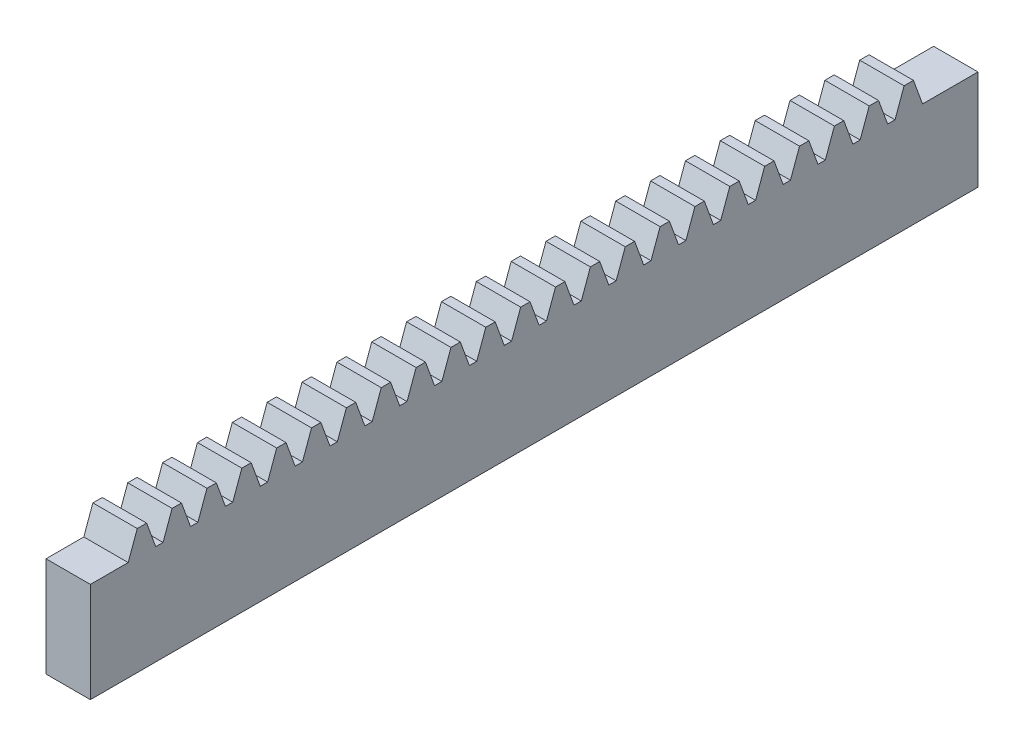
from build123d import *

# Parameters (mm, degrees)
SKETCH1_W           = 18
SKETCH1_H           = 160
BOSS_EXTRUDE1_DEPTH = 8
BOSS_EXTRUDE2_DEPTH = 8
LPATTERN1_COUNT     = 23
LPATTERN1_PITCH     = 6.283


with BuildPart() as part:
    # Sketch1 → Boss-Extrude1 (new body)
    with BuildSketch(Plane.YZ):
        Rectangle(SKETCH1_W, SKETCH1_H)
    extrude(amount=BOSS_EXTRUDE1_DEPTH)

    # Sketch2 → Boss-Extrude2 (add)
    with BuildSketch(Plane.YZ):
        Polygon((9, -70), (9, -65.04), (13.5, -66.675), (13.5, -67.52), (13.5, -68.365), align=None)
    boss_extrude2 = extrude(amount=BOSS_EXTRUDE2_DEPTH)

    # LPattern1: Boss-Extrude2 ×23
    with Locations(*[(0, 0, i * LPATTERN1_PITCH) for i in range(1, LPATTERN1_COUNT)]):
        add(boss_extrude2)


solid = part.part
